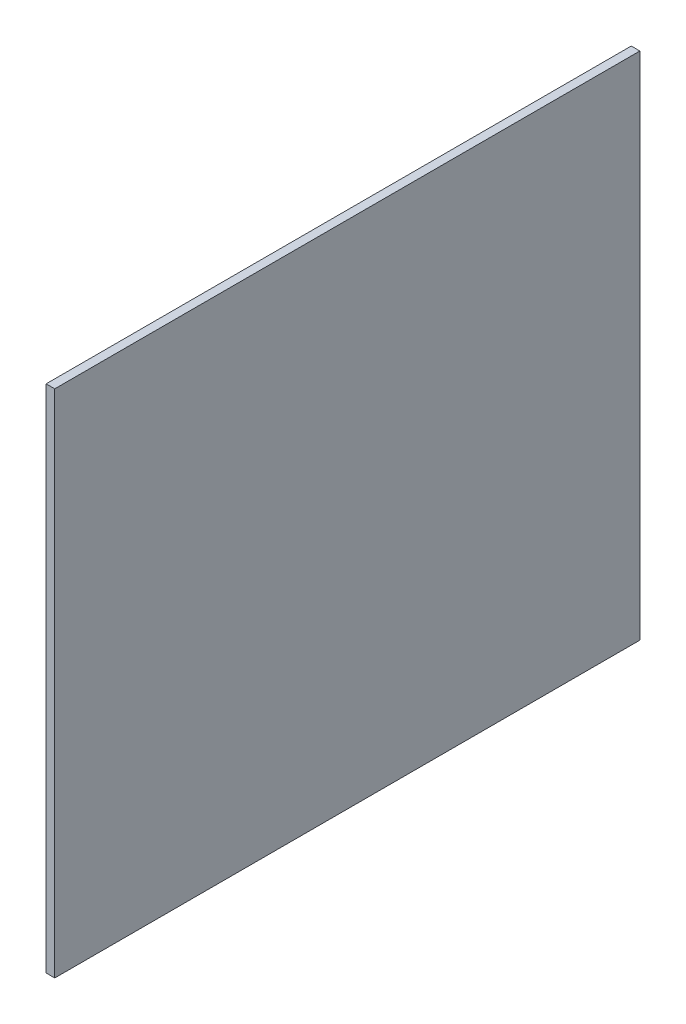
ISO-10303-21;
HEADER;
FILE_DESCRIPTION(('STEP AP214'),'2;1');
FILE_NAME('part.step','',(''),(''),'','','');
FILE_SCHEMA(('AUTOMOTIVE_DESIGN { 1 0 10303 214 1 1 1 1 }'));
ENDSEC;
DATA;
#1=APPLICATION_CONTEXT('core data for automotive mechanical design processes');
#2=APPLICATION_PROTOCOL_DEFINITION('international standard','automotive_design',2000,#1);
#3=PRODUCT_CONTEXT('',#1,'mechanical');
#4=PRODUCT('Part','Part','',(#3));
#5=PRODUCT_RELATED_PRODUCT_CATEGORY('part','',(#4));
#6=PRODUCT_DEFINITION_FORMATION('','',#4);
#7=PRODUCT_DEFINITION_CONTEXT('part definition',#1,'design');
#8=PRODUCT_DEFINITION('design','',#6,#7);
#9=PRODUCT_DEFINITION_SHAPE('','',#8);
#10=(LENGTH_UNIT() NAMED_UNIT(*) SI_UNIT(.MILLI.,.METRE.));
#11=(NAMED_UNIT(*) PLANE_ANGLE_UNIT() SI_UNIT($,.RADIAN.));
#12=(NAMED_UNIT(*) SI_UNIT($,.STERADIAN.) SOLID_ANGLE_UNIT());
#13=UNCERTAINTY_MEASURE_WITH_UNIT(LENGTH_MEASURE(1.E-05),#10,'distance_accuracy_value','');
#14=(GEOMETRIC_REPRESENTATION_CONTEXT(3) GLOBAL_UNCERTAINTY_ASSIGNED_CONTEXT((#13)) GLOBAL_UNIT_ASSIGNED_CONTEXT((#10,
#11,#12)) REPRESENTATION_CONTEXT('',''));
#15=CARTESIAN_POINT('',(0.,0.,0.));
#16=DIRECTION('',(0.,0.,1.));
#17=DIRECTION('',(1.,0.,0.));
#18=AXIS2_PLACEMENT_3D('',#15,#16,#17);
#19=CARTESIAN_POINT('',(-5.56,-10.46704180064,21.345337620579));
#20=DIRECTION('',(-1.,0.,0.));
#21=DIRECTION('',(0.,-1.,0.));
#22=AXIS2_PLACEMENT_3D('',#19,#20,#21);
#23=PLANE('',#22);
#24=DIRECTION('',(0.,1.,0.));
#25=VECTOR('',#24,1.);
#26=CARTESIAN_POINT('',(-5.56,-10.17122186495,22.023794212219));
#27=LINE('',#26,#25);
#28=CARTESIAN_POINT('',(-5.56,-10.17122186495,22.023794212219));
#29=VERTEX_POINT('',#28);
#30=CARTESIAN_POINT('',(-5.56,-10.76286173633,22.023794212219));
#31=VERTEX_POINT('',#30);
#32=EDGE_CURVE('E58',#29,#31,#27,.F.);
#33=ORIENTED_EDGE('',*,*,#32,.F.);
#34=DIRECTION('',(0.,0.,1.));
#35=VECTOR('',#34,1.);
#36=CARTESIAN_POINT('',(-5.56,-10.17122186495,21.345337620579));
#37=LINE('',#36,#35);
#38=CARTESIAN_POINT('',(-5.56,-10.17122186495,21.345337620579));
#39=VERTEX_POINT('',#38);
#40=EDGE_CURVE('E53',#39,#29,#37,.T.);
#41=ORIENTED_EDGE('',*,*,#40,.F.);
#42=DIRECTION('',(0.,1.,0.));
#43=VECTOR('',#42,1.);
#44=CARTESIAN_POINT('',(-5.56,-10.76286173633,21.345337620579));
#45=LINE('',#44,#43);
#46=CARTESIAN_POINT('',(-5.56,-10.76286173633,21.345337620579));
#47=VERTEX_POINT('',#46);
#48=EDGE_CURVE('E68',#47,#39,#45,.T.);
#49=ORIENTED_EDGE('',*,*,#48,.F.);
#50=DIRECTION('',(0.,0.,1.));
#51=VECTOR('',#50,1.);
#52=CARTESIAN_POINT('',(-5.56,-10.76286173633,22.023794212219));
#53=LINE('',#52,#51);
#54=EDGE_CURVE('E20',#31,#47,#53,.F.);
#55=ORIENTED_EDGE('',*,*,#54,.F.);
#56=EDGE_LOOP('',(#33,#41,#49,#55));
#57=FACE_BOUND('',#56,.T.);
#58=ADVANCED_FACE('F17',(#57),#23,.T.);
#59=CARTESIAN_POINT('',(-5.56,-10.76286173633,22.023794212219));
#60=DIRECTION('',(0.,-1.,0.));
#61=DIRECTION('',(1.,0.,0.));
#62=AXIS2_PLACEMENT_3D('',#59,#60,#61);
#63=PLANE('',#62);
#64=ORIENTED_EDGE('',*,*,#54,.T.);
#65=DIRECTION('',(-1.,0.,0.));
#66=VECTOR('',#65,1.);
#67=CARTESIAN_POINT('',(-5.56,-10.76286173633,21.345337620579));
#68=LINE('',#67,#66);
#69=CARTESIAN_POINT('',(-5.55,-10.76286173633,21.345337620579));
#70=VERTEX_POINT('',#69);
#71=EDGE_CURVE('E79',#70,#47,#68,.T.);
#72=ORIENTED_EDGE('',*,*,#71,.F.);
#73=DIRECTION('',(0.,0.,1.));
#74=VECTOR('',#73,1.);
#75=CARTESIAN_POINT('',(-5.55,-10.76286173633,21.345337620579));
#76=LINE('',#75,#74);
#77=CARTESIAN_POINT('',(-5.55,-10.76286173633,22.023794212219));
#78=VERTEX_POINT('',#77);
#79=EDGE_CURVE('E74',#70,#78,#76,.T.);
#80=ORIENTED_EDGE('',*,*,#79,.T.);
#81=DIRECTION('',(1.,0.,0.));
#82=VECTOR('',#81,1.);
#83=CARTESIAN_POINT('',(-5.56,-10.76286173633,22.023794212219));
#84=LINE('',#83,#82);
#85=EDGE_CURVE('E63',#31,#78,#84,.T.);
#86=ORIENTED_EDGE('',*,*,#85,.F.);
#87=EDGE_LOOP('',(#64,#72,#80,#86));
#88=FACE_BOUND('',#87,.T.);
#89=ADVANCED_FACE('F73',(#88),#63,.T.);
#90=CARTESIAN_POINT('',(-5.56,-10.17122186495,22.023794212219));
#91=DIRECTION('',(0.,0.,1.));
#92=DIRECTION('',(1.,0.,0.));
#93=AXIS2_PLACEMENT_3D('',#90,#91,#92);
#94=PLANE('',#93);
#95=ORIENTED_EDGE('',*,*,#32,.T.);
#96=ORIENTED_EDGE('',*,*,#85,.T.);
#97=DIRECTION('',(0.,-1.,0.));
#98=VECTOR('',#97,1.);
#99=CARTESIAN_POINT('',(-5.55,-10.46704180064,22.023794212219));
#100=LINE('',#99,#98);
#101=CARTESIAN_POINT('',(-5.55,-10.17122186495,22.023794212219));
#102=VERTEX_POINT('',#101);
#103=EDGE_CURVE('E84',#78,#102,#100,.F.);
#104=ORIENTED_EDGE('',*,*,#103,.T.);
#105=DIRECTION('',(-1.,0.,0.));
#106=VECTOR('',#105,1.);
#107=CARTESIAN_POINT('',(-5.56,-10.17122186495,22.023794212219));
#108=LINE('',#107,#106);
#109=EDGE_CURVE('E65',#29,#102,#108,.F.);
#110=ORIENTED_EDGE('',*,*,#109,.F.);
#111=EDGE_LOOP('',(#95,#96,#104,#110));
#112=FACE_BOUND('',#111,.T.);
#113=ADVANCED_FACE('F60',(#112),#94,.T.);
#114=CARTESIAN_POINT('',(-5.56,-10.17122186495,21.345337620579));
#115=DIRECTION('',(0.,1.,0.));
#116=DIRECTION('',(-1.,0.,0.));
#117=AXIS2_PLACEMENT_3D('',#114,#115,#116);
#118=PLANE('',#117);
#119=ORIENTED_EDGE('',*,*,#40,.T.);
#120=ORIENTED_EDGE('',*,*,#109,.T.);
#121=DIRECTION('',(0.,0.,1.));
#122=VECTOR('',#121,1.);
#123=CARTESIAN_POINT('',(-5.55,-10.17122186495,21.345337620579));
#124=LINE('',#123,#122);
#125=CARTESIAN_POINT('',(-5.55,-10.17122186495,21.345337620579));
#126=VERTEX_POINT('',#125);
#127=EDGE_CURVE('E26',#102,#126,#124,.F.);
#128=ORIENTED_EDGE('',*,*,#127,.T.);
#129=DIRECTION('',(-1.,0.,0.));
#130=VECTOR('',#129,1.);
#131=CARTESIAN_POINT('',(-5.56,-10.17122186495,21.345337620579));
#132=LINE('',#131,#130);
#133=EDGE_CURVE('E34',#39,#126,#132,.F.);
#134=ORIENTED_EDGE('',*,*,#133,.F.);
#135=EDGE_LOOP('',(#119,#120,#128,#134));
#136=FACE_BOUND('',#135,.T.);
#137=ADVANCED_FACE('F88',(#136),#118,.T.);
#138=CARTESIAN_POINT('',(-5.56,-10.76286173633,21.345337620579));
#139=DIRECTION('',(0.,0.,-1.));
#140=DIRECTION('',(-1.,0.,0.));
#141=AXIS2_PLACEMENT_3D('',#138,#139,#140);
#142=PLANE('',#141);
#143=ORIENTED_EDGE('',*,*,#48,.T.);
#144=ORIENTED_EDGE('',*,*,#133,.T.);
#145=DIRECTION('',(0.,-1.,0.));
#146=VECTOR('',#145,1.);
#147=CARTESIAN_POINT('',(-5.55,-10.46704180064,21.345337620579));
#148=LINE('',#147,#146);
#149=EDGE_CURVE('E11',#126,#70,#148,.T.);
#150=ORIENTED_EDGE('',*,*,#149,.T.);
#151=ORIENTED_EDGE('',*,*,#71,.T.);
#152=EDGE_LOOP('',(#143,#144,#150,#151));
#153=FACE_BOUND('',#152,.T.);
#154=ADVANCED_FACE('F91',(#153),#142,.T.);
#155=CARTESIAN_POINT('',(-5.55,-10.46704180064,21.345337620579));
#156=DIRECTION('',(-1.,0.,0.));
#157=DIRECTION('',(0.,-1.,0.));
#158=AXIS2_PLACEMENT_3D('',#155,#156,#157);
#159=PLANE('',#158);
#160=ORIENTED_EDGE('',*,*,#127,.F.);
#161=ORIENTED_EDGE('',*,*,#103,.F.);
#162=ORIENTED_EDGE('',*,*,#79,.F.);
#163=ORIENTED_EDGE('',*,*,#149,.F.);
#164=EDGE_LOOP('',(#160,#161,#162,#163));
#165=FACE_BOUND('',#164,.T.);
#166=ADVANCED_FACE('F90',(#165),#159,.F.);
#167=CLOSED_SHELL('',(#58,#89,#113,#137,#154,#166));
#168=MANIFOLD_SOLID_BREP('B1',#167);
#169=ADVANCED_BREP_SHAPE_REPRESENTATION('',(#18,#168),#14);
#170=SHAPE_DEFINITION_REPRESENTATION(#9,#169);
ENDSEC;
END-ISO-10303-21;
